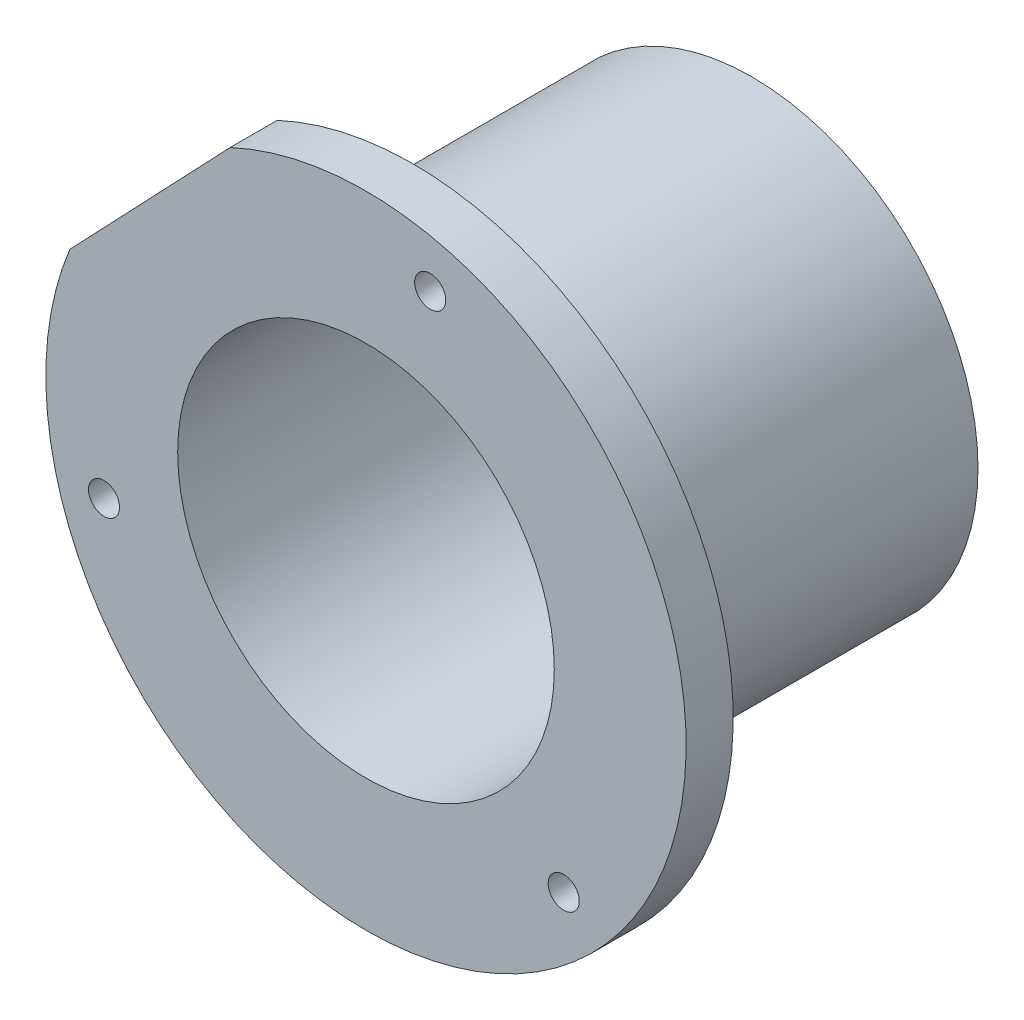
from build123d import *

# Parameters (mm, degrees)
EXTRUDE_1_DEPTH      = 2
EXTRUDE_1_DEPTH_BACK = 34
SKETCH_2_R           = 24
SKETCH_2_R_2         = 20
SKETCH_3_R           = 20
SKETCH_3_R_2         = 15
EXTRUDE_2_DEPTH      = 4
SKETCH_4_R           = 20
EXTRUDE_3_DEPTH      = 5
HOLE_WIZARD_M4_1_D   = 3.3


with BuildPart() as part:
    # Sketch 2 → Extrude 1 (new, two sides: drawn at the far end of the back side and taken through both)
    with BuildSketch(Plane.XY.offset(-EXTRUDE_1_DEPTH_BACK)):
        with Locations((17, 52)):
            Circle(SKETCH_2_R)
        with Locations((17, 52)):
            Circle(SKETCH_2_R_2, mode=Mode.SUBTRACT)
    extrude(amount=EXTRUDE_1_DEPTH + EXTRUDE_1_DEPTH_BACK)

    # Sketch 3 → Extrude 2 (add)
    with BuildSketch(Plane(origin=(0, 0, -34), x_dir=(-1, 0, 0), z_dir=(0, 0, -1))):
        with Locations((-17, 52)):
            Circle(SKETCH_3_R)
        with Locations((-17, 52)):
            Circle(SKETCH_3_R_2, mode=Mode.SUBTRACT)
    extrude(amount=-EXTRUDE_2_DEPTH)

    # Sketch 4 → Extrude 3 (add)
    with BuildSketch(Plane.XY.offset(2)):
        with BuildLine():
            Line((2.569924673, 82.785920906), (-14.452802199, 64.912057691))
            ThreePointArc((-14.452802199, 64.912057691), (41.620689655, 28.551724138), (2.569924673, 82.785920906))
        make_face()
        with Locations(Location((17, 52, 0), (0, 0, 180))):
            Circle(SKETCH_4_R, mode=Mode.SUBTRACT)
    extrude(amount=EXTRUDE_3_DEPTH)

    # Hole Wizard M4 _1 (through all)
    with Locations(Plane.XY.offset(7)):
        with Locations((23.820508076, 80.186533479), (-10.820508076, 43.813466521), (38, 32)):
            Hole(HOLE_WIZARD_M4_1_D / 2)


solid = part.part
